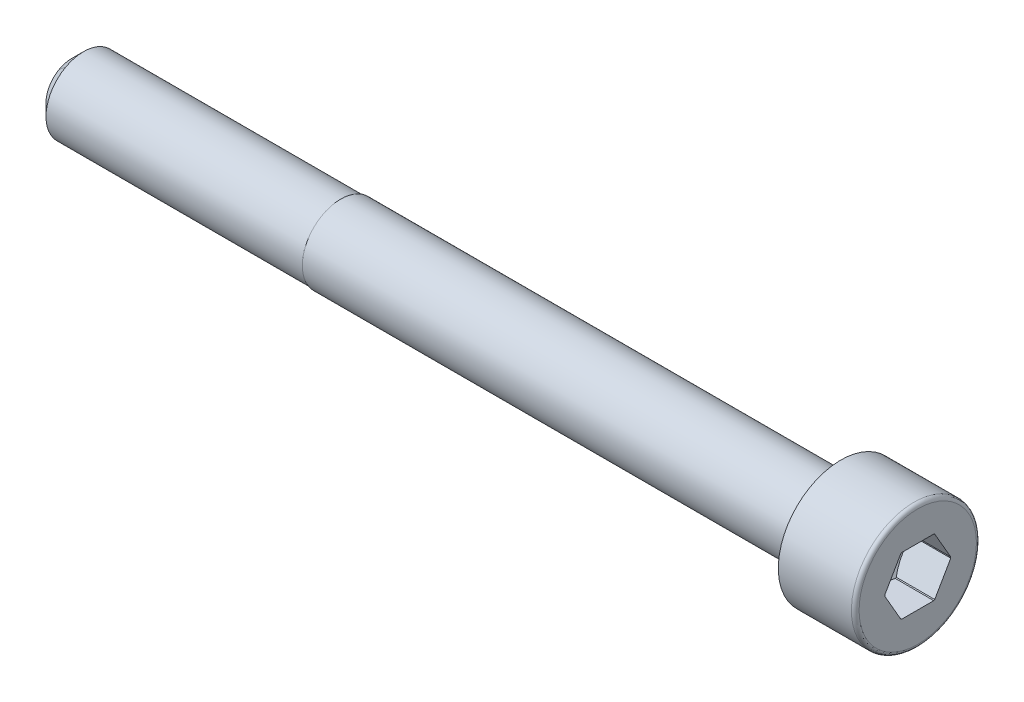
ISO-10303-21;
HEADER;
FILE_DESCRIPTION(('STEP AP214'),'2;1');
FILE_NAME('part.step','',(''),(''),'','','');
FILE_SCHEMA(('AUTOMOTIVE_DESIGN { 1 0 10303 214 1 1 1 1 }'));
ENDSEC;
DATA;
#1=APPLICATION_CONTEXT('core data for automotive mechanical design processes');
#2=APPLICATION_PROTOCOL_DEFINITION('international standard','automotive_design',2000,#1);
#3=PRODUCT_CONTEXT('',#1,'mechanical');
#4=PRODUCT('Part','Part','',(#3));
#5=PRODUCT_RELATED_PRODUCT_CATEGORY('part','',(#4));
#6=PRODUCT_DEFINITION_FORMATION('','',#4);
#7=PRODUCT_DEFINITION_CONTEXT('part definition',#1,'design');
#8=PRODUCT_DEFINITION('design','',#6,#7);
#9=PRODUCT_DEFINITION_SHAPE('','',#8);
#10=(LENGTH_UNIT() NAMED_UNIT(*) SI_UNIT(.MILLI.,.METRE.));
#11=(NAMED_UNIT(*) PLANE_ANGLE_UNIT() SI_UNIT($,.RADIAN.));
#12=(NAMED_UNIT(*) SI_UNIT($,.STERADIAN.) SOLID_ANGLE_UNIT());
#13=UNCERTAINTY_MEASURE_WITH_UNIT(LENGTH_MEASURE(1.E-05),#10,'distance_accuracy_value','');
#14=(GEOMETRIC_REPRESENTATION_CONTEXT(3) GLOBAL_UNCERTAINTY_ASSIGNED_CONTEXT((#13)) GLOBAL_UNIT_ASSIGNED_CONTEXT((#10,
#11,#12)) REPRESENTATION_CONTEXT('',''));
#15=CARTESIAN_POINT('',(0.,0.,0.));
#16=DIRECTION('',(0.,0.,1.));
#17=DIRECTION('',(1.,0.,0.));
#18=AXIS2_PLACEMENT_3D('',#15,#16,#17);
#19=CARTESIAN_POINT('',(5.00941127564,0.,0.));
#20=DIRECTION('',(-1.,0.,0.));
#21=DIRECTION('',(0.,0.,1.));
#22=AXIS2_PLACEMENT_3D('',#19,#20,#21);
#23=CYLINDRICAL_SURFACE('',#22,3.4315);
#24=DIRECTION('',(1.,0.,0.));
#25=VECTOR('',#24,1.);
#26=CARTESIAN_POINT('',(8.,3.,-1.66589082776));
#27=LINE('',#26,#25);
#28=CARTESIAN_POINT('',(4.00000000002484,3.,-1.66589082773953));
#29=VERTEX_POINT('',#28);
#30=CARTESIAN_POINT('',(8.,3.,-1.66589082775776));
#31=VERTEX_POINT('',#30);
#32=EDGE_CURVE('E153',#29,#31,#27,.T.);
#33=ORIENTED_EDGE('',*,*,#32,.F.);
#34=CARTESIAN_POINT('',(4.0000000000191,0.,0.));
#35=DIRECTION('',(1.,0.,0.));
#36=DIRECTION('',(0.,0.479425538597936,0.877582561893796));
#37=AXIS2_PLACEMENT_3D('',#34,#35,#36);
#38=CIRCLE('',#37,3.43149999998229);
#39=CARTESIAN_POINT('',(4.0000000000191,2.94270377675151,-1.76513079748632));
#40=VERTEX_POINT('',#39);
#41=EDGE_CURVE('E148',#29,#40,#38,.F.);
#42=ORIENTED_EDGE('',*,*,#41,.T.);
#43=DIRECTION('',(1.,0.,0.));
#44=VECTOR('',#43,1.);
#45=CARTESIAN_POINT('',(8.,2.94270377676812,-1.76513079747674));
#46=LINE('',#45,#44);
#47=CARTESIAN_POINT('',(8.,2.94270377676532,-1.76513079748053));
#48=VERTEX_POINT('',#47);
#49=EDGE_CURVE('E147',#48,#40,#46,.F.);
#50=ORIENTED_EDGE('',*,*,#49,.F.);
#51=CARTESIAN_POINT('',(8.,0.,0.));
#52=DIRECTION('',(1.,0.,0.));
#53=DIRECTION('',(0.,0.,-1.));
#54=AXIS2_PLACEMENT_3D('',#51,#52,#53);
#55=CIRCLE('',#54,3.4315);
#56=EDGE_CURVE('E132',#31,#48,#55,.F.);
#57=ORIENTED_EDGE('',*,*,#56,.F.);
#58=EDGE_LOOP('',(#33,#42,#50,#57));
#59=FACE_BOUND('',#58,.T.);
#60=ADVANCED_FACE('F16',(#59),#23,.F.);
#61=CARTESIAN_POINT('',(5.00941127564,0.,0.));
#62=DIRECTION('',(-1.,0.,0.));
#63=DIRECTION('',(0.,0.,1.));
#64=AXIS2_PLACEMENT_3D('',#61,#62,#63);
#65=CYLINDRICAL_SURFACE('',#64,3.4315);
#66=DIRECTION('',(1.,0.,0.));
#67=VECTOR('',#66,1.);
#68=CARTESIAN_POINT('',(8.,-0.0572962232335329,-3.43102162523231));
#69=LINE('',#68,#67);
#70=CARTESIAN_POINT('',(8.,-0.057296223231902,-3.43102162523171));
#71=VERTEX_POINT('',#70);
#72=CARTESIAN_POINT('',(4.0000000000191,-0.0572962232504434,-3.43102162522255));
#73=VERTEX_POINT('',#72);
#74=EDGE_CURVE('E392',#71,#73,#69,.F.);
#75=ORIENTED_EDGE('',*,*,#74,.F.);
#76=CARTESIAN_POINT('',(8.,0.,0.));
#77=DIRECTION('',(1.,0.,0.));
#78=DIRECTION('',(0.,0.,-1.));
#79=AXIS2_PLACEMENT_3D('',#76,#77,#78);
#80=CIRCLE('',#79,3.4315);
#81=CARTESIAN_POINT('',(8.,0.0572962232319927,-3.43102162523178));
#82=VERTEX_POINT('',#81);
#83=EDGE_CURVE('E144',#82,#71,#80,.F.);
#84=ORIENTED_EDGE('',*,*,#83,.F.);
#85=DIRECTION('',(1.,0.,0.));
#86=VECTOR('',#85,1.);
#87=CARTESIAN_POINT('',(8.,0.0572962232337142,-3.43102162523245));
#88=LINE('',#87,#86);
#89=CARTESIAN_POINT('',(4.00000000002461,0.0572962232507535,-3.43102162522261));
#90=VERTEX_POINT('',#89);
#91=EDGE_CURVE('E158',#90,#82,#88,.T.);
#92=ORIENTED_EDGE('',*,*,#91,.F.);
#93=CARTESIAN_POINT('',(4.0000000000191,0.,0.));
#94=DIRECTION('',(1.,0.,0.));
#95=DIRECTION('',(0.,0.479425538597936,0.877582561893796));
#96=AXIS2_PLACEMENT_3D('',#93,#94,#95);
#97=CIRCLE('',#96,3.43149999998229);
#98=EDGE_CURVE('E168',#90,#73,#97,.F.);
#99=ORIENTED_EDGE('',*,*,#98,.T.);
#100=EDGE_LOOP('',(#75,#84,#92,#99));
#101=FACE_BOUND('',#100,.T.);
#102=ADVANCED_FACE('F427',(#101),#65,.F.);
#103=CARTESIAN_POINT('',(5.00941127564,0.,0.));
#104=DIRECTION('',(-1.,0.,0.));
#105=DIRECTION('',(0.,0.,1.));
#106=AXIS2_PLACEMENT_3D('',#103,#104,#105);
#107=CYLINDRICAL_SURFACE('',#106,3.4315);
#108=CARTESIAN_POINT('',(4.0000000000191,0.,0.));
#109=DIRECTION('',(1.,0.,0.));
#110=DIRECTION('',(0.,0.479425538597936,0.877582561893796));
#111=AXIS2_PLACEMENT_3D('',#108,#109,#110);
#112=CIRCLE('',#111,3.43149999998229);
#113=CARTESIAN_POINT('',(4.00000000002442,-2.94270377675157,-1.76513079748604));
#114=VERTEX_POINT('',#113);
#115=CARTESIAN_POINT('',(4.0000000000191,-3.,-1.66589082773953));
#116=VERTEX_POINT('',#115);
#117=EDGE_CURVE('E270',#114,#116,#112,.F.);
#118=ORIENTED_EDGE('',*,*,#117,.T.);
#119=DIRECTION('',(1.,0.,0.));
#120=VECTOR('',#119,1.);
#121=CARTESIAN_POINT('',(8.,-3.,-1.66589082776));
#122=LINE('',#121,#120);
#123=CARTESIAN_POINT('',(8.,-3.,-1.66589082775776));
#124=VERTEX_POINT('',#123);
#125=EDGE_CURVE('E241',#124,#116,#122,.F.);
#126=ORIENTED_EDGE('',*,*,#125,.F.);
#127=CARTESIAN_POINT('',(8.,0.,0.));
#128=DIRECTION('',(1.,0.,0.));
#129=DIRECTION('',(0.,0.,-1.));
#130=AXIS2_PLACEMENT_3D('',#127,#128,#129);
#131=CIRCLE('',#130,3.4315);
#132=CARTESIAN_POINT('',(8.,-2.94270377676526,-1.76513079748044));
#133=VERTEX_POINT('',#132);
#134=EDGE_CURVE('E273',#133,#124,#131,.F.);
#135=ORIENTED_EDGE('',*,*,#134,.F.);
#136=DIRECTION('',(1.,0.,0.));
#137=VECTOR('',#136,1.);
#138=CARTESIAN_POINT('',(8.,-2.94270377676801,-1.76513079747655));
#139=LINE('',#138,#137);
#140=EDGE_CURVE('E389',#114,#133,#139,.T.);
#141=ORIENTED_EDGE('',*,*,#140,.F.);
#142=EDGE_LOOP('',(#118,#126,#135,#141));
#143=FACE_BOUND('',#142,.T.);
#144=ADVANCED_FACE('F416',(#143),#107,.F.);
#145=CARTESIAN_POINT('',(5.00941127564,0.,0.));
#146=DIRECTION('',(-1.,0.,0.));
#147=DIRECTION('',(0.,0.,1.));
#148=AXIS2_PLACEMENT_3D('',#145,#146,#147);
#149=CYLINDRICAL_SURFACE('',#148,3.4315);
#150=DIRECTION('',(1.,0.,0.));
#151=VECTOR('',#150,1.);
#152=CARTESIAN_POINT('',(8.,-3.,1.66589082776));
#153=LINE('',#152,#151);
#154=CARTESIAN_POINT('',(4.00000000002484,-3.,1.66589082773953));
#155=VERTEX_POINT('',#154);
#156=CARTESIAN_POINT('',(8.,-3.,1.66589082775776));
#157=VERTEX_POINT('',#156);
#158=EDGE_CURVE('E240',#155,#157,#153,.T.);
#159=ORIENTED_EDGE('',*,*,#158,.F.);
#160=CARTESIAN_POINT('',(4.0000000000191,0.,0.));
#161=DIRECTION('',(1.,0.,0.));
#162=DIRECTION('',(0.,0.479425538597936,0.877582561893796));
#163=AXIS2_PLACEMENT_3D('',#160,#161,#162);
#164=CIRCLE('',#163,3.43149999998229);
#165=CARTESIAN_POINT('',(4.0000000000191,-2.94270377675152,1.76513079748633));
#166=VERTEX_POINT('',#165);
#167=EDGE_CURVE('E406',#155,#166,#164,.F.);
#168=ORIENTED_EDGE('',*,*,#167,.T.);
#169=DIRECTION('',(1.,0.,0.));
#170=VECTOR('',#169,1.);
#171=CARTESIAN_POINT('',(8.,-2.94270377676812,1.76513079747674));
#172=LINE('',#171,#170);
#173=CARTESIAN_POINT('',(8.,-2.94270377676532,1.76513079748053));
#174=VERTEX_POINT('',#173);
#175=EDGE_CURVE('E382',#174,#166,#172,.F.);
#176=ORIENTED_EDGE('',*,*,#175,.F.);
#177=CARTESIAN_POINT('',(8.,0.,0.));
#178=DIRECTION('',(1.,0.,0.));
#179=DIRECTION('',(0.,0.,-1.));
#180=AXIS2_PLACEMENT_3D('',#177,#178,#179);
#181=CIRCLE('',#180,3.4315);
#182=EDGE_CURVE('E271',#157,#174,#181,.F.);
#183=ORIENTED_EDGE('',*,*,#182,.F.);
#184=EDGE_LOOP('',(#159,#168,#176,#183));
#185=FACE_BOUND('',#184,.T.);
#186=ADVANCED_FACE('F441',(#185),#149,.F.);
#187=CARTESIAN_POINT('',(5.00941127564,0.,0.));
#188=DIRECTION('',(-1.,0.,0.));
#189=DIRECTION('',(0.,0.,1.));
#190=AXIS2_PLACEMENT_3D('',#187,#188,#189);
#191=CYLINDRICAL_SURFACE('',#190,3.4315);
#192=DIRECTION('',(1.,0.,0.));
#193=VECTOR('',#192,1.);
#194=CARTESIAN_POINT('',(8.,0.0572962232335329,3.43102162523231));
#195=LINE('',#194,#193);
#196=CARTESIAN_POINT('',(8.,0.057296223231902,3.43102162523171));
#197=VERTEX_POINT('',#196);
#198=CARTESIAN_POINT('',(4.0000000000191,0.0572962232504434,3.43102162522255));
#199=VERTEX_POINT('',#198);
#200=EDGE_CURVE('E197',#197,#199,#195,.F.);
#201=ORIENTED_EDGE('',*,*,#200,.F.);
#202=CARTESIAN_POINT('',(8.,0.,0.));
#203=DIRECTION('',(1.,0.,0.));
#204=DIRECTION('',(0.,0.,-1.));
#205=AXIS2_PLACEMENT_3D('',#202,#203,#204);
#206=CIRCLE('',#205,3.4315);
#207=CARTESIAN_POINT('',(8.,-0.0572962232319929,3.43102162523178));
#208=VERTEX_POINT('',#207);
#209=EDGE_CURVE('E268',#208,#197,#206,.F.);
#210=ORIENTED_EDGE('',*,*,#209,.F.);
#211=DIRECTION('',(1.,0.,0.));
#212=VECTOR('',#211,1.);
#213=CARTESIAN_POINT('',(8.,-0.0572962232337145,3.43102162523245));
#214=LINE('',#213,#212);
#215=CARTESIAN_POINT('',(4.00000000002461,-0.057296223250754,3.43102162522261));
#216=VERTEX_POINT('',#215);
#217=EDGE_CURVE('E379',#216,#208,#214,.T.);
#218=ORIENTED_EDGE('',*,*,#217,.F.);
#219=CARTESIAN_POINT('',(4.0000000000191,0.,0.));
#220=DIRECTION('',(1.,0.,0.));
#221=DIRECTION('',(0.,0.479425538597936,0.877582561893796));
#222=AXIS2_PLACEMENT_3D('',#219,#220,#221);
#223=CIRCLE('',#222,3.43149999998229);
#224=EDGE_CURVE('E169',#216,#199,#223,.F.);
#225=ORIENTED_EDGE('',*,*,#224,.T.);
#226=EDGE_LOOP('',(#201,#210,#218,#225));
#227=FACE_BOUND('',#226,.T.);
#228=ADVANCED_FACE('F213',(#227),#191,.F.);
#229=CARTESIAN_POINT('',(4.0000000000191,0.,0.));
#230=DIRECTION('',(1.,0.,0.));
#231=DIRECTION('',(0.,0.,-1.));
#232=AXIS2_PLACEMENT_3D('',#229,#230,#231);
#233=CONICAL_SURFACE('',#232,3.43149999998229,1.0471975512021);
#234=CARTESIAN_POINT('',(2.02219020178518,-3.92209341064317E-12,2.14264945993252E-12));
#235=VERTEX_POINT('',#234);
#236=VERTEX_LOOP('',#235);
#237=FACE_BOUND('',#236,.T.);
#238=CARTESIAN_POINT('',(4.00000000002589,0.0572962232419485,3.43102162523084));
#239=CARTESIAN_POINT('',(3.96325492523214,0.17081183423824,3.36548335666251));
#240=CARTESIAN_POINT('',(3.929566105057,0.28514686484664,3.29947199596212));
#241=CARTESIAN_POINT('',(3.86970967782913,0.515490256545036,3.16648317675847));
#242=CARTESIAN_POINT('',(3.8435558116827,0.631501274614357,3.09950418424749));
#243=CARTESIAN_POINT('',(3.80077359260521,0.862380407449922,2.96620605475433));
#244=CARTESIAN_POINT('',(3.78395759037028,0.977221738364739,2.899902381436));
#245=CARTESIAN_POINT('',(3.76016083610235,1.20757941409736,2.76690531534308));
#246=CARTESIAN_POINT('',(3.75317159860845,1.32309508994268,2.70021230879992));
#247=CARTESIAN_POINT('',(3.74938304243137,1.56424529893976,2.56098417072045));
#248=CARTESIAN_POINT('',(3.75351627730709,1.68989180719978,2.48844212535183));
#249=CARTESIAN_POINT('',(3.77363673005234,1.94058202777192,2.34370605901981));
#250=CARTESIAN_POINT('',(3.78963616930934,2.06562498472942,2.2715124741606));
#251=CARTESIAN_POINT('',(3.83267808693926,2.31719015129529,2.1262712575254));
#252=CARTESIAN_POINT('',(3.85996753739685,2.4436796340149,2.05324252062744));
#253=CARTESIAN_POINT('',(3.92364198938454,2.69467514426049,1.90833019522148));
#254=CARTESIAN_POINT('',(3.96000827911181,2.81918469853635,1.83644457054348));
#255=CARTESIAN_POINT('',(4.00000000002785,2.94270377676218,1.76513079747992));
#256=B_SPLINE_CURVE_WITH_KNOTS('',3,(#238,#239,#240,#241,#242,#243,#244,#245,#246,#247,#248,
#249,#250,#251,#252,#253,#254,#255),.UNSPECIFIED.,.F.,.F.,(4,2,2,2,2,2,2,2,4),(0.,
0.408481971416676,0.817704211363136,1.21837417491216,1.61869794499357,2.05360864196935,
2.48896789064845,2.93440148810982,3.3789243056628),.UNSPECIFIED.);
#257=CARTESIAN_POINT('',(4.00000000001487,2.94270377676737,1.76513079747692));
#258=VERTEX_POINT('',#257);
#259=EDGE_CURVE('E189',#199,#258,#256,.T.);
#260=ORIENTED_EDGE('',*,*,#259,.F.);
#261=ORIENTED_EDGE('',*,*,#224,.F.);
#262=CARTESIAN_POINT('',(4.00000000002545,-2.94270377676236,1.76513079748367));
#263=CARTESIAN_POINT('',(3.95761571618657,-2.8118234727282,1.84069457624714));
#264=CARTESIAN_POINT('',(3.9193099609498,-2.67981268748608,1.9169110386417));
#265=CARTESIAN_POINT('',(3.85299680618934,-2.41358638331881,2.07061686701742));
#266=CARTESIAN_POINT('',(3.82501189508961,-2.27936670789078,2.14810863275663));
#267=CARTESIAN_POINT('',(3.78220050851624,-2.01256396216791,2.30214726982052));
#268=CARTESIAN_POINT('',(3.76707654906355,-1.88001803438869,2.37867269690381));
#269=CARTESIAN_POINT('',(3.75031731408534,-1.61441682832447,2.53201762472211));
#270=CARTESIAN_POINT('',(3.74866675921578,-1.4813622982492,2.60883669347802));
#271=CARTESIAN_POINT('',(3.75800702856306,-1.240344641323,2.7479883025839));
#272=CARTESIAN_POINT('',(3.76670796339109,-1.13230895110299,2.81036273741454));
#273=CARTESIAN_POINT('',(3.79254998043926,-0.916926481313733,2.93471386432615));
#274=CARTESIAN_POINT('',(3.80969720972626,-0.809580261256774,2.99669023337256));
#275=CARTESIAN_POINT('',(3.8518773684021,-0.593876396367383,3.12122691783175));
#276=CARTESIAN_POINT('',(3.8770609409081,-0.485541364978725,3.18377417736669));
#277=CARTESIAN_POINT('',(3.93394629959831,-0.270335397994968,3.30802340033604));
#278=CARTESIAN_POINT('',(3.96563762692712,-0.163462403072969,3.36972655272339));
#279=CARTESIAN_POINT('',(4.00000000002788,-0.0572962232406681,3.43102162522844));
#280=B_SPLINE_CURVE_WITH_KNOTS('',3,(#262,#263,#264,#265,#266,#267,#268,#269,#270,#271,#272,
#273,#274,#275,#276,#277,#278,#279),.UNSPECIFIED.,.F.,.F.,(4,2,2,2,2,2,2,2,4),(0.,
0.471055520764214,0.943131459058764,1.40396540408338,1.86427667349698,2.23913478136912,
2.61426610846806,2.99688901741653,3.37890174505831),.UNSPECIFIED.);
#281=EDGE_CURVE('E198',#166,#216,#280,.T.);
#282=ORIENTED_EDGE('',*,*,#281,.F.);
#283=ORIENTED_EDGE('',*,*,#167,.F.);
#284=CARTESIAN_POINT('',(4.00000000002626,-3.000000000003,-1.66589082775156));
#285=CARTESIAN_POINT('',(3.95761571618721,-3.00000000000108,-1.51476327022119));
#286=CARTESIAN_POINT('',(3.91930996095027,-3.00000000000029,-1.36233034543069));
#287=CARTESIAN_POINT('',(3.85299680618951,-2.99999999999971,-1.05491868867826));
#288=CARTESIAN_POINT('',(3.82501189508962,-2.99999999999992,-0.899935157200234));
#289=CARTESIAN_POINT('',(3.78220050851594,-3.00000000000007,-0.591857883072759));
#290=CARTESIAN_POINT('',(3.76707654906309,-3.00000000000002,-0.438807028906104));
#291=CARTESIAN_POINT('',(3.75031731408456,-2.99999999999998,-0.132117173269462));
#292=CARTESIAN_POINT('',(3.74866675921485,-2.99999999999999,0.0215209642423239));
#293=CARTESIAN_POINT('',(3.75800702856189,-3.,0.299824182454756));
#294=CARTESIAN_POINT('',(3.76670796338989,-3.,0.424573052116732));
#295=CARTESIAN_POINT('',(3.79254998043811,-3.,0.673275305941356));
#296=CARTESIAN_POINT('',(3.80969720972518,-3.,0.797228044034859));
#297=CARTESIAN_POINT('',(3.85187736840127,-3.,1.04630141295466));
#298=CARTESIAN_POINT('',(3.87706094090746,-3.,1.17139593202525));
#299=CARTESIAN_POINT('',(3.93394629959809,-3.,1.41989437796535));
#300=CARTESIAN_POINT('',(3.96563762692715,-3.,1.54330068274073));
#301=CARTESIAN_POINT('',(4.00000000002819,-3.,1.6658908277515));
#302=B_SPLINE_CURVE_WITH_KNOTS('',3,(#284,#285,#286,#287,#288,#289,#290,#291,#292,#293,#294,
#295,#296,#297,#298,#299,#300,#301),.UNSPECIFIED.,.F.,.F.,(4,2,2,2,2,2,2,2,4),(0.,
0.471055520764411,0.943131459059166,1.40396540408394,1.86427667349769,2.23913478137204,
2.61426610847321,2.99688901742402,3.37890174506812),.UNSPECIFIED.);
#303=EDGE_CURVE('E234',#116,#155,#302,.T.);
#304=ORIENTED_EDGE('',*,*,#303,.F.);
#305=ORIENTED_EDGE('',*,*,#117,.F.);
#306=CARTESIAN_POINT('',(4.00000000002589,-0.0572962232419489,-3.43102162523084));
#307=CARTESIAN_POINT('',(3.96325492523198,-0.170811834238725,-3.36548335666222));
#308=CARTESIAN_POINT('',(3.92956610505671,-0.285146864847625,-3.29947199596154));
#309=CARTESIAN_POINT('',(3.86970967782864,-0.515490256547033,-3.16648317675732));
#310=CARTESIAN_POINT('',(3.84355581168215,-0.631501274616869,-3.09950418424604));
#311=CARTESIAN_POINT('',(3.80077359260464,-0.862380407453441,-2.96620605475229));
#312=CARTESIAN_POINT('',(3.78395759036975,-0.977221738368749,-2.89990238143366));
#313=CARTESIAN_POINT('',(3.76016083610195,-1.20757941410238,-2.7669053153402));
#314=CARTESIAN_POINT('',(3.75317159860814,-1.32309508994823,-2.70021230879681));
#315=CARTESIAN_POINT('',(3.74938304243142,-1.5642452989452,-2.56098417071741));
#316=CARTESIAN_POINT('',(3.75351627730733,-1.68989180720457,-2.4884421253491));
#317=CARTESIAN_POINT('',(3.77363673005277,-1.94058202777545,-2.34370605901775));
#318=CARTESIAN_POINT('',(3.78963616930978,-2.06562498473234,-2.27151247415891));
#319=CARTESIAN_POINT('',(3.83267808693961,-2.31719015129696,-2.12627125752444));
#320=CARTESIAN_POINT('',(3.8599675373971,-2.44367963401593,-2.05324252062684));
#321=CARTESIAN_POINT('',(3.92364198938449,-2.69467514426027,-1.9083301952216));
#322=CARTESIAN_POINT('',(3.96000827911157,-2.81918469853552,-1.83644457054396));
#323=CARTESIAN_POINT('',(4.00000000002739,-2.94270377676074,-1.76513079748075));
#324=B_SPLINE_CURVE_WITH_KNOTS('',3,(#306,#307,#308,#309,#310,#311,#312,#313,#314,#315,#316,
#317,#318,#319,#320,#321,#322,#323),.UNSPECIFIED.,.F.,.F.,(4,2,2,2,2,2,2,2,4),(0.,
0.408481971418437,0.817704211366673,1.2183741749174,1.6186979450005,2.05360864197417,
2.48896789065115,2.93440148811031,3.37892430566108),.UNSPECIFIED.);
#325=EDGE_CURVE('E229',#73,#114,#324,.T.);
#326=ORIENTED_EDGE('',*,*,#325,.F.);
#327=ORIENTED_EDGE('',*,*,#98,.F.);
#328=CARTESIAN_POINT('',(4.00000000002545,2.94270377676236,-1.76513079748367));
#329=CARTESIAN_POINT('',(3.95761571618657,2.8118234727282,-1.84069457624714));
#330=CARTESIAN_POINT('',(3.91930996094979,2.67981268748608,-1.9169110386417));
#331=CARTESIAN_POINT('',(3.85299680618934,2.41358638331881,-2.07061686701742));
#332=CARTESIAN_POINT('',(3.82501189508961,2.27936670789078,-2.14810863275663));
#333=CARTESIAN_POINT('',(3.78220050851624,2.0125639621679,-2.30214726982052));
#334=CARTESIAN_POINT('',(3.76707654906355,1.88001803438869,-2.37867269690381));
#335=CARTESIAN_POINT('',(3.75031731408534,1.61441682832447,-2.53201762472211));
#336=CARTESIAN_POINT('',(3.74866675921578,1.4813622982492,-2.60883669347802));
#337=CARTESIAN_POINT('',(3.75800702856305,1.240344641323,-2.7479883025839));
#338=CARTESIAN_POINT('',(3.76670796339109,1.13230895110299,-2.81036273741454));
#339=CARTESIAN_POINT('',(3.79254998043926,0.916926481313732,-2.93471386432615));
#340=CARTESIAN_POINT('',(3.80969720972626,0.809580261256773,-2.99669023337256));
#341=CARTESIAN_POINT('',(3.8518773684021,0.593876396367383,-3.12122691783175));
#342=CARTESIAN_POINT('',(3.8770609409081,0.485541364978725,-3.18377417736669));
#343=CARTESIAN_POINT('',(3.93394629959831,0.270335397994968,-3.30802340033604));
#344=CARTESIAN_POINT('',(3.96563762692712,0.163462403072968,-3.36972655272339));
#345=CARTESIAN_POINT('',(4.00000000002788,0.0572962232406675,-3.43102162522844));
#346=B_SPLINE_CURVE_WITH_KNOTS('',3,(#328,#329,#330,#331,#332,#333,#334,#335,#336,#337,#338,
#339,#340,#341,#342,#343,#344,#345),.UNSPECIFIED.,.F.,.F.,(4,2,2,2,2,2,2,2,4),(0.,
0.471055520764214,0.943131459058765,1.40396540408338,1.86427667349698,2.23913478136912,
2.61426610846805,2.99688901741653,3.37890174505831),.UNSPECIFIED.);
#347=EDGE_CURVE('E152',#40,#90,#346,.T.);
#348=ORIENTED_EDGE('',*,*,#347,.F.);
#349=ORIENTED_EDGE('',*,*,#41,.F.);
#350=CARTESIAN_POINT('',(4.00000000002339,3.00000000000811,1.66589082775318));
#351=CARTESIAN_POINT('',(3.95761571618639,3.00000000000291,1.51476327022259));
#352=CARTESIAN_POINT('',(3.91930996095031,3.00000000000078,1.36233034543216));
#353=CARTESIAN_POINT('',(3.85299680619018,2.99999999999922,1.05491868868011));
#354=CARTESIAN_POINT('',(3.82501189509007,2.99999999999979,0.899935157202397));
#355=CARTESIAN_POINT('',(3.78220050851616,3.0000000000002,0.591857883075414));
#356=CARTESIAN_POINT('',(3.76707654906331,3.00000000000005,0.438807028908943));
#357=CARTESIAN_POINT('',(3.75031731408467,2.99999999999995,0.132117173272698));
#358=CARTESIAN_POINT('',(3.74866675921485,2.99999999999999,-0.021520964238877));
#359=CARTESIAN_POINT('',(3.75800702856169,3.00000000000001,-0.299824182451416));
#360=CARTESIAN_POINT('',(3.76670796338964,3.,-0.424573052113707));
#361=CARTESIAN_POINT('',(3.7925499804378,3.,-0.673275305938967));
#362=CARTESIAN_POINT('',(3.80969720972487,3.,-0.797228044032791));
#363=CARTESIAN_POINT('',(3.85187736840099,3.,-1.04630141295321));
#364=CARTESIAN_POINT('',(3.87706094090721,3.,-1.1713959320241));
#365=CARTESIAN_POINT('',(3.93394629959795,3.,-1.41989437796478));
#366=CARTESIAN_POINT('',(3.96563762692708,3.,-1.54330068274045));
#367=CARTESIAN_POINT('',(4.00000000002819,3.,-1.6658908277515));
#368=B_SPLINE_CURVE_WITH_KNOTS('',3,(#350,#351,#352,#353,#354,#355,#356,#357,#358,#359,#360,
#361,#362,#363,#364,#365,#366,#367),.UNSPECIFIED.,.F.,.F.,(4,2,2,2,2,2,2,2,4),(0.,
0.471055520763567,0.943131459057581,1.40396540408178,1.86427667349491,2.23913478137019,
2.61426610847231,2.99688901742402,3.378901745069),.UNSPECIFIED.);
#369=CARTESIAN_POINT('',(4.00000000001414,3.,1.6658908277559));
#370=VERTEX_POINT('',#369);
#371=EDGE_CURVE('E258',#370,#29,#368,.T.);
#372=ORIENTED_EDGE('',*,*,#371,.F.);
#373=CARTESIAN_POINT('',(4.,0.,0.));
#374=DIRECTION('',(-1.,0.,0.));
#375=DIRECTION('',(0.,0.,1.));
#376=AXIS2_PLACEMENT_3D('',#373,#374,#375);
#377=CIRCLE('',#376,3.4315);
#378=EDGE_CURVE('E267',#370,#258,#377,.F.);
#379=ORIENTED_EDGE('',*,*,#378,.T.);
#380=EDGE_LOOP('',(#260,#261,#282,#283,#304,#305,#326,#327,#348,#349,#372,#379));
#381=FACE_BOUND('',#380,.T.);
#382=ADVANCED_FACE('F207',(#237,#381),#233,.F.);
#383=CARTESIAN_POINT('',(5.00941127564,0.,0.));
#384=DIRECTION('',(-1.,0.,0.));
#385=DIRECTION('',(0.,0.,1.));
#386=AXIS2_PLACEMENT_3D('',#383,#384,#385);
#387=CYLINDRICAL_SURFACE('',#386,3.4315);
#388=ORIENTED_EDGE('',*,*,#378,.F.);
#389=DIRECTION('',(1.,0.,0.));
#390=VECTOR('',#389,1.);
#391=CARTESIAN_POINT('',(8.,3.,1.66589082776));
#392=LINE('',#391,#390);
#393=CARTESIAN_POINT('',(8.,3.,1.66589082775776));
#394=VERTEX_POINT('',#393);
#395=EDGE_CURVE('E264',#394,#370,#392,.F.);
#396=ORIENTED_EDGE('',*,*,#395,.F.);
#397=CARTESIAN_POINT('',(8.,0.,0.));
#398=DIRECTION('',(1.,0.,0.));
#399=DIRECTION('',(0.,0.,-1.));
#400=AXIS2_PLACEMENT_3D('',#397,#398,#399);
#401=CIRCLE('',#400,3.4315);
#402=CARTESIAN_POINT('',(8.,2.94270377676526,1.76513079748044));
#403=VERTEX_POINT('',#402);
#404=EDGE_CURVE('E265',#403,#394,#401,.F.);
#405=ORIENTED_EDGE('',*,*,#404,.F.);
#406=DIRECTION('',(1.,0.,0.));
#407=VECTOR('',#406,1.);
#408=CARTESIAN_POINT('',(8.,2.94270377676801,1.76513079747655));
#409=LINE('',#408,#407);
#410=EDGE_CURVE('E164',#258,#403,#409,.T.);
#411=ORIENTED_EDGE('',*,*,#410,.F.);
#412=EDGE_LOOP('',(#388,#396,#405,#411));
#413=FACE_BOUND('',#412,.T.);
#414=ADVANCED_FACE('F212',(#413),#387,.F.);
#415=CARTESIAN_POINT('',(8.,3.,-1.73205080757));
#416=DIRECTION('',(0.,-1.,0.));
#417=DIRECTION('',(0.,0.,-1.));
#418=AXIS2_PLACEMENT_3D('',#415,#416,#417);
#419=PLANE('',#418);
#420=ORIENTED_EDGE('',*,*,#371,.T.);
#421=ORIENTED_EDGE('',*,*,#32,.T.);
#422=DIRECTION('',(0.,0.,-1.));
#423=VECTOR('',#422,1.);
#424=CARTESIAN_POINT('',(8.,3.,0.));
#425=LINE('',#424,#423);
#426=EDGE_CURVE('E143',#394,#31,#425,.T.);
#427=ORIENTED_EDGE('',*,*,#426,.F.);
#428=ORIENTED_EDGE('',*,*,#395,.T.);
#429=EDGE_LOOP('',(#420,#421,#427,#428));
#430=FACE_BOUND('',#429,.T.);
#431=ADVANCED_FACE('F254',(#430),#419,.T.);
#432=CARTESIAN_POINT('',(8.,0.,-3.46410161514));
#433=DIRECTION('',(0.,-0.50000000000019,0.866025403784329));
#434=DIRECTION('',(0.,-0.866025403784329,-0.50000000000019));
#435=AXIS2_PLACEMENT_3D('',#432,#433,#434);
#436=PLANE('',#435);
#437=ORIENTED_EDGE('',*,*,#347,.T.);
#438=ORIENTED_EDGE('',*,*,#91,.T.);
#439=DIRECTION('',(0.,-0.866025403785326,-0.499999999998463));
#440=VECTOR('',#439,1.);
#441=CARTESIAN_POINT('',(8.,2.94270377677,-1.76513079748));
#442=LINE('',#441,#440);
#443=EDGE_CURVE('E141',#48,#82,#442,.T.);
#444=ORIENTED_EDGE('',*,*,#443,.F.);
#445=ORIENTED_EDGE('',*,*,#49,.T.);
#446=EDGE_LOOP('',(#437,#438,#444,#445));
#447=FACE_BOUND('',#446,.T.);
#448=ADVANCED_FACE('F156',(#447),#436,.T.);
#449=CARTESIAN_POINT('',(8.,-3.,-1.73205080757));
#450=DIRECTION('',(0.,0.50000000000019,0.866025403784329));
#451=DIRECTION('',(0.,-0.866025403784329,0.50000000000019));
#452=AXIS2_PLACEMENT_3D('',#449,#450,#451);
#453=PLANE('',#452);
#454=ORIENTED_EDGE('',*,*,#325,.T.);
#455=ORIENTED_EDGE('',*,*,#140,.T.);
#456=DIRECTION('',(0.,-0.866025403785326,0.499999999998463));
#457=VECTOR('',#456,1.);
#458=CARTESIAN_POINT('',(8.,-0.0572962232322,-3.43102162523));
#459=LINE('',#458,#457);
#460=EDGE_CURVE('E159',#71,#133,#459,.T.);
#461=ORIENTED_EDGE('',*,*,#460,.F.);
#462=ORIENTED_EDGE('',*,*,#74,.T.);
#463=EDGE_LOOP('',(#454,#455,#461,#462));
#464=FACE_BOUND('',#463,.T.);
#465=ADVANCED_FACE('F246',(#464),#453,.T.);
#466=CARTESIAN_POINT('',(8.,-3.,1.73205080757));
#467=DIRECTION('',(0.,1.,0.));
#468=DIRECTION('',(0.,0.,1.));
#469=AXIS2_PLACEMENT_3D('',#466,#467,#468);
#470=PLANE('',#469);
#471=ORIENTED_EDGE('',*,*,#303,.T.);
#472=ORIENTED_EDGE('',*,*,#158,.T.);
#473=DIRECTION('',(0.,0.,-1.));
#474=VECTOR('',#473,1.);
#475=CARTESIAN_POINT('',(8.,-3.,0.));
#476=LINE('',#475,#474);
#477=EDGE_CURVE('E162',#124,#157,#476,.F.);
#478=ORIENTED_EDGE('',*,*,#477,.F.);
#479=ORIENTED_EDGE('',*,*,#125,.T.);
#480=EDGE_LOOP('',(#471,#472,#478,#479));
#481=FACE_BOUND('',#480,.T.);
#482=ADVANCED_FACE('F242',(#481),#470,.T.);
#483=CARTESIAN_POINT('',(8.,0.,3.46410161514));
#484=DIRECTION('',(0.,0.50000000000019,-0.866025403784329));
#485=DIRECTION('',(0.,0.866025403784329,0.50000000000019));
#486=AXIS2_PLACEMENT_3D('',#483,#484,#485);
#487=PLANE('',#486);
#488=ORIENTED_EDGE('',*,*,#281,.T.);
#489=ORIENTED_EDGE('',*,*,#217,.T.);
#490=DIRECTION('',(0.,0.866025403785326,0.499999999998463));
#491=VECTOR('',#490,1.);
#492=CARTESIAN_POINT('',(8.,-2.94270377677,1.76513079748));
#493=LINE('',#492,#491);
#494=EDGE_CURVE('E403',#174,#208,#493,.T.);
#495=ORIENTED_EDGE('',*,*,#494,.F.);
#496=ORIENTED_EDGE('',*,*,#175,.T.);
#497=EDGE_LOOP('',(#488,#489,#495,#496));
#498=FACE_BOUND('',#497,.T.);
#499=ADVANCED_FACE('F245',(#498),#487,.T.);
#500=CARTESIAN_POINT('',(8.,3.,1.73205080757));
#501=DIRECTION('',(0.,-0.50000000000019,-0.866025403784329));
#502=DIRECTION('',(0.,0.866025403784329,-0.50000000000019));
#503=AXIS2_PLACEMENT_3D('',#500,#501,#502);
#504=PLANE('',#503);
#505=ORIENTED_EDGE('',*,*,#259,.T.);
#506=ORIENTED_EDGE('',*,*,#410,.T.);
#507=DIRECTION('',(0.,0.866025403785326,-0.499999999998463));
#508=VECTOR('',#507,1.);
#509=CARTESIAN_POINT('',(8.,0.0572962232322,3.43102162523));
#510=LINE('',#509,#508);
#511=EDGE_CURVE('E400',#197,#403,#510,.T.);
#512=ORIENTED_EDGE('',*,*,#511,.F.);
#513=ORIENTED_EDGE('',*,*,#200,.T.);
#514=EDGE_LOOP('',(#505,#506,#512,#513));
#515=FACE_BOUND('',#514,.T.);
#516=ADVANCED_FACE('F204',(#515),#504,.T.);
#517=CARTESIAN_POINT('',(8.,0.,0.));
#518=DIRECTION('',(1.,0.,0.));
#519=DIRECTION('',(0.,0.,-1.));
#520=AXIS2_PLACEMENT_3D('',#517,#518,#519);
#521=PLANE('',#520);
#522=ORIENTED_EDGE('',*,*,#511,.T.);
#523=ORIENTED_EDGE('',*,*,#404,.T.);
#524=ORIENTED_EDGE('',*,*,#426,.T.);
#525=ORIENTED_EDGE('',*,*,#56,.T.);
#526=ORIENTED_EDGE('',*,*,#443,.T.);
#527=ORIENTED_EDGE('',*,*,#83,.T.);
#528=ORIENTED_EDGE('',*,*,#460,.T.);
#529=ORIENTED_EDGE('',*,*,#134,.T.);
#530=ORIENTED_EDGE('',*,*,#477,.T.);
#531=ORIENTED_EDGE('',*,*,#182,.T.);
#532=ORIENTED_EDGE('',*,*,#494,.T.);
#533=ORIENTED_EDGE('',*,*,#209,.T.);
#534=EDGE_LOOP('',(#522,#523,#524,#525,#526,#527,#528,#529,#530,#531,#532,#533));
#535=FACE_BOUND('',#534,.T.);
#536=CARTESIAN_POINT('',(8.,0.,0.));
#537=DIRECTION('',(-1.,0.,0.));
#538=DIRECTION('',(0.,1.,0.));
#539=AXIS2_PLACEMENT_3D('',#536,#537,#538);
#540=CIRCLE('',#539,6.1);
#541=CARTESIAN_POINT('',(8.,6.1,0.));
#542=VERTEX_POINT('',#541);
#543=CARTESIAN_POINT('',(8.,-6.1,0.));
#544=VERTEX_POINT('',#543);
#545=EDGE_CURVE('E188',#542,#544,#540,.T.);
#546=ORIENTED_EDGE('',*,*,#545,.F.);
#547=CARTESIAN_POINT('',(8.,0.,0.));
#548=DIRECTION('',(-1.,0.,0.));
#549=DIRECTION('',(0.,-1.,0.));
#550=AXIS2_PLACEMENT_3D('',#547,#548,#549);
#551=CIRCLE('',#550,6.1);
#552=EDGE_CURVE('E402',#544,#542,#551,.T.);
#553=ORIENTED_EDGE('',*,*,#552,.F.);
#554=EDGE_LOOP('',(#546,#553));
#555=FACE_BOUND('',#554,.T.);
#556=ADVANCED_FACE('F138',(#535,#555),#521,.T.);
#557=CARTESIAN_POINT('',(-80.,3.90243902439,0.));
#558=DIRECTION('',(1.,0.,0.));
#559=DIRECTION('',(0.,0.,-1.));
#560=AXIS2_PLACEMENT_3D('',#557,#558,#559);
#561=PLANE('',#560);
#562=CARTESIAN_POINT('',(-79.999999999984,0.,-1.36822301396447E-13));
#563=DIRECTION('',(1.,0.,1.0945784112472E-13));
#564=DIRECTION('',(1.0945784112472E-13,0.,-1.));
#565=AXIS2_PLACEMENT_3D('',#562,#563,#564);
#566=CIRCLE('',#565,2.65243902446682);
#567=CARTESIAN_POINT('',(-79.9999999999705,-2.32773423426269,-1.27164700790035));
#568=VERTEX_POINT('',#567);
#569=CARTESIAN_POINT('',(-79.999999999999,2.32773423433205,1.27164700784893));
#570=VERTEX_POINT('',#569);
#571=EDGE_CURVE('E181',#568,#570,#566,.T.);
#572=ORIENTED_EDGE('',*,*,#571,.F.);
#573=CARTESIAN_POINT('',(-79.9999999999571,0.,0.));
#574=DIRECTION('',(1.,0.,0.));
#575=DIRECTION('',(0.,0.,-1.));
#576=AXIS2_PLACEMENT_3D('',#573,#574,#575);
#577=CIRCLE('',#576,2.65243902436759);
#578=EDGE_CURVE('E186',#570,#568,#577,.T.);
#579=ORIENTED_EDGE('',*,*,#578,.F.);
#580=EDGE_LOOP('',(#572,#579));
#581=FACE_BOUND('',#580,.T.);
#582=ADVANCED_FACE('F359',(#581),#561,.F.);
#583=CARTESIAN_POINT('',(7.6,0.,0.));
#584=DIRECTION('',(1.,0.,0.));
#585=DIRECTION('',(0.,-0.982387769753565,0.186853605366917));
#586=AXIS2_PLACEMENT_3D('',#583,#584,#585);
#587=TOROIDAL_SURFACE('',#586,6.1,0.4);
#588=CARTESIAN_POINT('',(7.6,0.,0.));
#589=DIRECTION('',(1.,0.,0.));
#590=DIRECTION('',(0.,0.,-1.));
#591=AXIS2_PLACEMENT_3D('',#588,#589,#590);
#592=CIRCLE('',#591,6.5);
#593=CARTESIAN_POINT('',(7.6,0.,-6.5));
#594=VERTEX_POINT('',#593);
#595=EDGE_CURVE('E335',#594,#594,#592,.F.);
#596=ORIENTED_EDGE('',*,*,#595,.F.);
#597=EDGE_LOOP('',(#596));
#598=FACE_BOUND('',#597,.T.);
#599=ORIENTED_EDGE('',*,*,#545,.T.);
#600=ORIENTED_EDGE('',*,*,#552,.T.);
#601=EDGE_LOOP('',(#599,#600));
#602=FACE_BOUND('',#601,.T.);
#603=ADVANCED_FACE('F353',(#598,#602),#587,.T.);
#604=CARTESIAN_POINT('',(-78.7500000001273,0.,0.));
#605=DIRECTION('',(1.,0.,0.));
#606=DIRECTION('',(0.,0.,-1.));
#607=AXIS2_PLACEMENT_3D('',#604,#605,#606);
#608=CONICAL_SURFACE('',#607,3.90243902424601,0.785398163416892);
#609=DIRECTION('',(-0.707106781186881,0.62054458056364,0.339005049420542));
#610=VECTOR('',#609,1.);
#611=CARTESIAN_POINT('',(499000.00000002,-437986.232722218,-239272.969453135));
#612=LINE('',#611,#610);
#613=CARTESIAN_POINT('',(-78.7500000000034,-3.42471243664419,-1.87092893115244));
#614=VERTEX_POINT('',#613);
#615=EDGE_CURVE('E185',#614,#568,#612,.T.);
#616=ORIENTED_EDGE('',*,*,#615,.F.);
#617=CARTESIAN_POINT('',(-78.75,0.,0.));
#618=DIRECTION('',(1.,0.,0.));
#619=DIRECTION('',(0.,0.,-1.));
#620=AXIS2_PLACEMENT_3D('',#617,#618,#619);
#621=CIRCLE('',#620,3.90243902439);
#622=CARTESIAN_POINT('',(-78.7500000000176,3.42471243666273,1.8709289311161));
#623=VERTEX_POINT('',#622);
#624=EDGE_CURVE('E327',#623,#614,#621,.T.);
#625=ORIENTED_EDGE('',*,*,#624,.F.);
#626=DIRECTION('',(-0.707106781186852,-0.620544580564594,-0.339005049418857));
#627=VECTOR('',#626,1.);
#628=CARTESIAN_POINT('',(498999.999999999,437986.232722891,239272.969451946));
#629=LINE('',#628,#627);
#630=EDGE_CURVE('E184',#570,#623,#629,.F.);
#631=ORIENTED_EDGE('',*,*,#630,.F.);
#632=ORIENTED_EDGE('',*,*,#578,.T.);
#633=EDGE_LOOP('',(#616,#625,#631,#632));
#634=FACE_BOUND('',#633,.T.);
#635=ADVANCED_FACE('F358',(#634),#608,.T.);
#636=CARTESIAN_POINT('',(-78.7500000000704,0.,0.));
#637=DIRECTION('',(1.,0.,1.0945784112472E-13));
#638=DIRECTION('',(1.0945784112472E-13,0.,-1.));
#639=AXIS2_PLACEMENT_3D('',#636,#637,#638);
#640=CONICAL_SURFACE('',#639,3.90243902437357,0.7853981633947);
#641=ORIENTED_EDGE('',*,*,#630,.T.);
#642=CARTESIAN_POINT('',(-78.75,0.,0.));
#643=DIRECTION('',(1.,0.,0.));
#644=DIRECTION('',(0.,0.,-1.));
#645=AXIS2_PLACEMENT_3D('',#642,#643,#644);
#646=CIRCLE('',#645,3.90243902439);
#647=EDGE_CURVE('E180',#614,#623,#646,.T.);
#648=ORIENTED_EDGE('',*,*,#647,.F.);
#649=ORIENTED_EDGE('',*,*,#615,.T.);
#650=ORIENTED_EDGE('',*,*,#571,.T.);
#651=EDGE_LOOP('',(#641,#648,#649,#650));
#652=FACE_BOUND('',#651,.T.);
#653=ADVANCED_FACE('F468',(#652),#640,.T.);
#654=CARTESIAN_POINT('',(4.,0.,0.));
#655=DIRECTION('',(1.,0.,0.));
#656=DIRECTION('',(0.,0.,-1.));
#657=AXIS2_PLACEMENT_3D('',#654,#655,#656);
#658=CYLINDRICAL_SURFACE('',#657,6.5);
#659=CARTESIAN_POINT('',(0.,0.,0.));
#660=DIRECTION('',(1.,0.,0.));
#661=DIRECTION('',(0.,0.,-1.));
#662=AXIS2_PLACEMENT_3D('',#659,#660,#661);
#663=CIRCLE('',#662,6.5);
#664=CARTESIAN_POINT('',(0.,0.,-6.5));
#665=VERTEX_POINT('',#664);
#666=EDGE_CURVE('E177',#665,#665,#663,.T.);
#667=ORIENTED_EDGE('',*,*,#666,.T.);
#668=EDGE_LOOP('',(#667));
#669=FACE_BOUND('',#668,.T.);
#670=ORIENTED_EDGE('',*,*,#595,.T.);
#671=EDGE_LOOP('',(#670));
#672=FACE_BOUND('',#671,.T.);
#673=ADVANCED_FACE('F465',(#669,#672),#658,.T.);
#674=CARTESIAN_POINT('',(-40.,0.,0.));
#675=DIRECTION('',(1.,0.,0.));
#676=DIRECTION('',(0.,0.,-1.));
#677=AXIS2_PLACEMENT_3D('',#674,#675,#676);
#678=CYLINDRICAL_SURFACE('',#677,3.90243902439);
#679=CARTESIAN_POINT('',(-52.,0.,0.));
#680=DIRECTION('',(1.,0.,0.));
#681=DIRECTION('',(0.,0.,-1.));
#682=AXIS2_PLACEMENT_3D('',#679,#680,#681);
#683=CIRCLE('',#682,3.90243902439);
#684=CARTESIAN_POINT('',(-52.,0.,-3.90243902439));
#685=VERTEX_POINT('',#684);
#686=EDGE_CURVE('E174',#685,#685,#683,.F.);
#687=ORIENTED_EDGE('',*,*,#686,.T.);
#688=EDGE_LOOP('',(#687));
#689=FACE_BOUND('',#688,.T.);
#690=ORIENTED_EDGE('',*,*,#647,.T.);
#691=ORIENTED_EDGE('',*,*,#624,.T.);
#692=EDGE_LOOP('',(#690,#691));
#693=FACE_BOUND('',#692,.T.);
#694=ADVANCED_FACE('F313',(#689,#693),#678,.T.);
#695=CARTESIAN_POINT('',(0.,0.,0.));
#696=DIRECTION('',(1.,0.,0.));
#697=DIRECTION('',(0.,0.,-1.));
#698=AXIS2_PLACEMENT_3D('',#695,#696,#697);
#699=PLANE('',#698);
#700=CARTESIAN_POINT('',(0.,-3.86136327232,-2.10947236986));
#701=CARTESIAN_POINT('',(-1.21326223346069E-09,-3.89670172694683,-2.0447857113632));
#702=CARTESIAN_POINT('',(1.32699946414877E-09,-3.93042770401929,-1.97921930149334));
#703=CARTESIAN_POINT('',(-7.12735861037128E-09,-3.99457332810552,-1.84649032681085));
#704=CARTESIAN_POINT('',(-1.81216945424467E-08,-4.02499304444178,-1.77932779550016));
#705=CARTESIAN_POINT('',(-7.46854945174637E-08,-4.08244629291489,-1.64356712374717));
#706=CARTESIAN_POINT('',(-1.20254996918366E-07,-4.10947982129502,-1.57496898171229));
#707=CARTESIAN_POINT('',(-3.20920916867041E-07,-4.15378429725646,-1.45382914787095));
#708=CARTESIAN_POINT('',(-4.4579385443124E-07,-4.17180647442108,-1.40155985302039));
#709=CARTESIAN_POINT('',(-7.86529102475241E-07,-4.21720698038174,-1.26125175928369));
#710=CARTESIAN_POINT('',(-1.00749011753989E-06,-4.24280088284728,-1.17262518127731));
#711=CARTESIAN_POINT('',(-1.03008738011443E-06,-4.28365374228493,-1.01179618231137));
#712=CARTESIAN_POINT('',(-9.06770494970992E-07,-4.29995593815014,-0.939855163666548));
#713=CARTESIAN_POINT('',(-5.32928166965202E-07,-4.32884272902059,-0.795237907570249));
#714=CARTESIAN_POINT('',(-2.82427293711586E-07,-4.34142804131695,-0.722561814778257));
#715=CARTESIAN_POINT('',(-5.71283372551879E-08,-4.35745076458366,-0.613144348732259));
#716=CARTESIAN_POINT('',(-7.10279579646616E-09,-4.36231562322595,-0.57660650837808));
#717=CARTESIAN_POINT('',(7.61830527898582E-09,-4.37147723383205,-0.500768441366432));
#718=CARTESIAN_POINT('',(-3.41427620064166E-08,-4.3757071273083,-0.461460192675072));
#719=CARTESIAN_POINT('',(-3.66066069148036E-08,-4.38286922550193,-0.387865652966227));
#720=CARTESIAN_POINT('',(-7.11556706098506E-09,-4.38589857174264,-0.353588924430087));
#721=CARTESIAN_POINT('',(3.90583451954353E-10,-4.38977859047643,-0.301263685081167));
#722=CARTESIAN_POINT('',(-3.79577869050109E-09,-4.39098059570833,-0.283241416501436));
#723=CARTESIAN_POINT('',(-1.20997767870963E-08,-4.39467156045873,-0.222194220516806));
#724=CARTESIAN_POINT('',(-8.07975338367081E-09,-4.39663511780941,-0.179137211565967));
#725=CARTESIAN_POINT('',(-1.79925341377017E-09,-4.40006944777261,-0.0677335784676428));
#726=CARTESIAN_POINT('',(-1.95073957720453E-09,-4.40057699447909,0.000645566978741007));
#727=CARTESIAN_POINT('',(-1.07862615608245E-09,-4.39882372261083,0.111157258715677));
#728=CARTESIAN_POINT('',(-4.82991361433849E-10,-4.39754902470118,0.153308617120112));
#729=CARTESIAN_POINT('',(4.56141549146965E-12,-4.3939811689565,0.233340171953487));
#730=CARTESIAN_POINT('',(-3.90380644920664E-11,-4.39180275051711,0.271225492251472));
#731=CARTESIAN_POINT('',(-6.36076822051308E-11,-4.38558392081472,0.359540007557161));
#732=CARTESIAN_POINT('',(-1.88741909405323E-11,-4.38116496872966,0.409943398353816));
#733=CARTESIAN_POINT('',(-7.86326993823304E-10,-4.37350339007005,0.482917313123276));
#734=CARTESIAN_POINT('',(-1.1411486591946E-09,-4.37094865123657,0.505562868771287));
#735=CARTESIAN_POINT('',(-2.77955427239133E-09,-4.35854622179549,0.608298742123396));
#736=CARTESIAN_POINT('',(-4.13237145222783E-09,-4.34666085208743,0.68815547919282));
#737=CARTESIAN_POINT('',(-4.79769467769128E-09,-4.31850731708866,0.847085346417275));
#738=CARTESIAN_POINT('',(-4.11019857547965E-09,-4.30223914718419,0.926158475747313));
#739=CARTESIAN_POINT('',(-1.70076409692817E-09,-4.26536392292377,1.08328789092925));
#740=CARTESIAN_POINT('',(2.11667740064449E-11,-4.24475690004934,1.16134418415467));
#741=CARTESIAN_POINT('',(-2.09990847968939E-11,-4.19945986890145,1.31559066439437));
#742=CARTESIAN_POINT('',(-1.75760423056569E-09,-4.17480347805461,1.39179073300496));
#743=CARTESIAN_POINT('',(-5.44383356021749E-09,-4.12138039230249,1.54273546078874));
#744=CARTESIAN_POINT('',(-7.39345565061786E-09,-4.09261373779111,1.61748013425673));
#745=CARTESIAN_POINT('',(-9.68641014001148E-09,-4.03105215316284,1.7652913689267));
#746=CARTESIAN_POINT('',(-1.00297492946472E-08,-3.99825723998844,1.83835793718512));
#747=CARTESIAN_POINT('',(-8.87258411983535E-09,-3.92873729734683,1.98259703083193));
#748=CARTESIAN_POINT('',(-7.372077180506E-09,-3.89201226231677,2.05376955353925));
#749=CARTESIAN_POINT('',(-3.70520611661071E-09,-3.81474019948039,2.19400909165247));
#750=CARTESIAN_POINT('',(-1.53883730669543E-09,-3.77419314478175,2.26307609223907));
#751=CARTESIAN_POINT('',(3.84283668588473E-10,-3.68939872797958,2.39890201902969));
#752=CARTESIAN_POINT('',(1.41005333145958E-10,-3.64515131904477,2.46566091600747));
#753=CARTESIAN_POINT('',(-5.75877902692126E-09,-3.55621082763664,2.59221232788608));
#754=CARTESIAN_POINT('',(-1.10462576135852E-08,-3.51175241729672,2.65216993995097));
#755=CARTESIAN_POINT('',(-2.24172395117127E-08,-3.41983707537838,2.76974297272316));
#756=CARTESIAN_POINT('',(-2.85007531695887E-08,-3.37238010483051,2.82735836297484));
#757=CARTESIAN_POINT('',(-3.94975654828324E-08,-3.27459320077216,2.94009785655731));
#758=CARTESIAN_POINT('',(-4.44108537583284E-08,-3.22426324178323,2.99522193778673));
#759=CARTESIAN_POINT('',(-5.15824017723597E-08,-3.12086057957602,3.10283524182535));
#760=CARTESIAN_POINT('',(-5.3840648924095E-08,-3.06778786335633,3.15532445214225));
#761=CARTESIAN_POINT('',(-5.51379303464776E-08,-2.95903779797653,3.25753153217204));
#762=CARTESIAN_POINT('',(-5.41769626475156E-08,-2.90336044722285,3.30724940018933));
#763=CARTESIAN_POINT('',(-4.92744496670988E-08,-2.78954591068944,3.40378463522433));
#764=CARTESIAN_POINT('',(-4.53329148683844E-08,-2.73140873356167,3.45060201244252));
#765=CARTESIAN_POINT('',(-3.55428109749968E-08,-2.61282545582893,3.54121407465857));
#766=CARTESIAN_POINT('',(-2.96942564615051E-08,-2.55237937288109,3.58500878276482));
#767=CARTESIAN_POINT('',(-1.7988083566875E-08,-2.42933653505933,3.66946349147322));
#768=CARTESIAN_POINT('',(-1.21304652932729E-08,-2.36673980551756,3.71012352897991));
#769=CARTESIAN_POINT('',(-3.13845934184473E-09,-2.23955456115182,3.78819649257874));
#770=CARTESIAN_POINT('',(-4.02835555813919E-12,-2.17496607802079,3.82560947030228));
#771=CARTESIAN_POINT('',(3.97604376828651E-12,-2.04483090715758,3.8966518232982));
#772=CARTESIAN_POINT('',(-3.04151106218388E-09,-1.97930762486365,3.93032409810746));
#773=CARTESIAN_POINT('',(8.40814574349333E-10,-1.84667292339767,3.99437327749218));
#774=CARTESIAN_POINT('',(7.76825386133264E-09,-1.7795615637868,4.02475030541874));
#775=CARTESIAN_POINT('',(-1.49390228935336E-08,-1.64391673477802,4.08214068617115));
#776=CARTESIAN_POINT('',(-4.45733173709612E-08,-1.5753832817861,4.10915407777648));
#777=CARTESIAN_POINT('',(-1.11275186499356E-07,-1.43704327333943,4.15970770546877));
#778=CARTESIAN_POINT('',(-1.48342868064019E-07,-1.36723669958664,4.18324789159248));
#779=CARTESIAN_POINT('',(-4.59277004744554E-07,-1.27682261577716,4.21135313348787));
#780=CARTESIAN_POINT('',(-5.45099036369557E-07,-1.25668683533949,4.21746204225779));
#781=CARTESIAN_POINT('',(-5.68293732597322E-07,-1.21834444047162,4.22870370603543));
#782=CARTESIAN_POINT('',(-5.19788091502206E-07,-1.200148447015,4.23387272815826));
#783=CARTESIAN_POINT('',(-2.90501853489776E-07,-1.1019423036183,4.26110322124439));
#784=CARTESIAN_POINT('',(-2.18240847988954E-07,-1.02133580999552,4.28107333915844));
#785=CARTESIAN_POINT('',(-9.87991029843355E-08,-0.885748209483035,4.3105719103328));
#786=CARTESIAN_POINT('',(-5.11709624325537E-08,-0.831039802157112,4.32137619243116));
#787=CARTESIAN_POINT('',(-1.66613784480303E-08,-0.74695004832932,4.33636055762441));
#788=CARTESIAN_POINT('',(-1.17824185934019E-08,-0.717697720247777,4.34127441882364));
#789=CARTESIAN_POINT('',(3.74351138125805E-10,-0.612665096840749,4.35784878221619));
#790=CARTESIAN_POINT('',(-7.99583020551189E-10,-0.536615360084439,4.36786009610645));
#791=CARTESIAN_POINT('',(-1.83592332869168E-09,-0.402709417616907,4.38195049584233));
#792=CARTESIAN_POINT('',(-1.94841342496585E-09,-0.344940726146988,4.3868809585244));
#793=CARTESIAN_POINT('',(-3.29119294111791E-09,-0.252882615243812,4.39291268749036));
#794=CARTESIAN_POINT('',(-4.04617592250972E-09,-0.218640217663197,4.39475543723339));
#795=CARTESIAN_POINT('',(-6.4700520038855E-09,-0.104444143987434,4.39956035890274));
#796=CARTESIAN_POINT('',(-8.01554872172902E-09,-0.0244071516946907,4.40073995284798));
#797=CARTESIAN_POINT('',(-1.04243442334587E-08,0.135606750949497,4.39872922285));
#798=CARTESIAN_POINT('',(-1.1287640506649E-08,0.215583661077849,4.39553888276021));
#799=CARTESIAN_POINT('',(-1.18562853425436E-08,0.375245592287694,4.38479753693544));
#800=CARTESIAN_POINT('',(-1.15616332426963E-08,0.454930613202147,4.37724652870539));
#801=CARTESIAN_POINT('',(-9.96535786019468E-09,0.613769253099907,4.35780624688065));
#802=CARTESIAN_POINT('',(-8.66373714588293E-09,0.692922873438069,4.34591698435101));
#803=CARTESIAN_POINT('',(-5.63136141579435E-09,0.850462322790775,4.31783646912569));
#804=CARTESIAN_POINT('',(-3.9006088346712E-09,0.928848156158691,4.30164524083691));
#805=CARTESIAN_POINT('',(-1.09155333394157E-09,1.08462037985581,4.2650062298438));
#806=CARTESIAN_POINT('',(-1.32446754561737E-11,1.16200677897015,4.24455848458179));
#807=CARTESIAN_POINT('',(9.85321290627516E-12,1.29588336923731,4.20525009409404));
#808=CARTESIAN_POINT('',(-5.69734755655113E-10,1.35265009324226,4.18732383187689));
#809=CARTESIAN_POINT('',(-1.98054317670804E-09,1.47134447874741,4.14718088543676));
#810=CARTESIAN_POINT('',(-2.83182052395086E-09,1.53318685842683,4.12471124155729));
#811=CARTESIAN_POINT('',(-4.3384802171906E-09,1.66163922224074,4.07475462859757));
#812=CARTESIAN_POINT('',(-4.96750542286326E-09,1.72814274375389,4.04699366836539));
#813=CARTESIAN_POINT('',(-5.76240067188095E-09,1.86542491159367,3.98568986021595));
#814=CARTESIAN_POINT('',(-5.8832694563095E-09,1.93607282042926,3.95185420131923));
#815=CARTESIAN_POINT('',(-5.61006161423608E-09,2.08104192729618,3.87760564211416));
#816=CARTESIAN_POINT('',(-5.1740403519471E-09,2.15520519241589,3.83688316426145));
#817=CARTESIAN_POINT('',(-4.27469070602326E-09,2.2666148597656,3.77146328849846));
#818=CARTESIAN_POINT('',(-3.92146741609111E-09,2.30475778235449,3.74827833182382));
#819=CARTESIAN_POINT('',(-3.1673912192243E-09,2.38164762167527,3.6999249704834));
#820=CARTESIAN_POINT('',(-2.76530220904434E-09,2.42036879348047,3.67471551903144));
#821=CARTESIAN_POINT('',(-1.97567586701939E-09,2.49829651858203,3.62221542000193));
#822=CARTESIAN_POINT('',(-1.58909345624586E-09,2.53747505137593,3.59488319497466));
#823=CARTESIAN_POINT('',(-8.79240342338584E-10,2.61619131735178,3.53804182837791));
#824=CARTESIAN_POINT('',(-5.58460257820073E-10,2.65569872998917,3.5084906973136));
#825=CARTESIAN_POINT('',(-1.54214274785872E-10,2.7349355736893,3.44711638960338));
#826=CARTESIAN_POINT('',(-7.86035424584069E-11,2.77463225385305,3.41525086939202));
#827=CARTESIAN_POINT('',(5.69205820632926E-11,2.84210246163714,3.35914585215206));
#828=CARTESIAN_POINT('',(1.15410532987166E-10,2.87014430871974,3.33522750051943));
#829=CARTESIAN_POINT('',(-2.42022813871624E-09,2.95336247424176,3.26243704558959));
#830=CARTESIAN_POINT('',(-7.72493791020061E-09,3.00763692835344,3.21252518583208));
#831=CARTESIAN_POINT('',(-4.10821121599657E-08,3.11362278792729,3.11006114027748));
#832=CARTESIAN_POINT('',(-6.91344336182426E-08,3.16533420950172,3.05750897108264));
#833=CARTESIAN_POINT('',(-2.48197800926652E-07,3.27868555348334,2.93644416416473));
#834=CARTESIAN_POINT('',(-4.28189772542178E-07,3.33957643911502,2.86722540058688));
#835=CARTESIAN_POINT('',(-8.01694739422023E-07,3.43342528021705,2.75349546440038));
#836=CARTESIAN_POINT('',(-9.61071840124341E-07,3.4678232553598,2.71016239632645));
#837=CARTESIAN_POINT('',(-1.16467968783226E-06,3.54608625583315,2.60753256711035));
#838=CARTESIAN_POINT('',(-1.15286426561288E-06,3.58928767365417,2.5477267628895));
#839=CARTESIAN_POINT('',(-9.04831250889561E-07,3.67254172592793,2.42598128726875));
#840=CARTESIAN_POINT('',(-6.68653382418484E-07,3.7125949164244,2.36404199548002));
#841=CARTESIAN_POINT('',(-2.37313758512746E-07,3.78944472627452,2.23819578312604));
#842=CARTESIAN_POINT('',(-4.21420642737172E-08,3.82624213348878,2.17428934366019));
#843=CARTESIAN_POINT('',(0.,3.86136327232,2.10947236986));
#844=B_SPLINE_CURVE_WITH_KNOTS('',3,(#700,#701,#702,#703,#704,#705,#706,#707,#708,#709,#710,
#711,#712,#713,#714,#715,#716,#717,#718,#719,#720,#721,#722,#723,#724,#725,#726,#727,#728,#729,
#730,#731,#732,#733,#734,#735,#736,#737,#738,#739,#740,#741,#742,#743,#744,#745,#746,#747,#748,
#749,#750,#751,#752,#753,#754,#755,#756,#757,#758,#759,#760,#761,#762,#763,#764,#765,#766,#767,
#768,#769,#770,#771,#772,#773,#774,#775,#776,#777,#778,#779,#780,#781,#782,#783,#784,#785,#786,
#787,#788,#789,#790,#791,#792,#793,#794,#795,#796,#797,#798,#799,#800,#801,#802,#803,#804,#805,
#806,#807,#808,#809,#810,#811,#812,#813,#814,#815,#816,#817,#818,#819,#820,#821,#822,#823,#824,
#825,#826,#827,#828,#829,#830,#831,#832,#833,#834,#835,#836,#837,#838,#839,#840,#841,#842,#843),
.UNSPECIFIED.,.F.,.F.,(4,2,2,2,2,2,2,2,2,2,2,2,2,2,2,2,2,2,2,2,2,2,2,2,2,2,2,2,2,2,2,2,2,2,2,2,
2,2,2,2,2,2,2,2,2,2,2,2,2,2,2,2,2,2,2,2,2,2,2,2,2,2,2,2,2,2,2,2,2,2,2,4),(0.,0.221105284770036,
0.442205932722,0.663306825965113,0.82914309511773,1.10567241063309,1.32687885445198,
1.54804258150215,1.65861319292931,1.77720883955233,1.8804303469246,1.9346155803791,
2.06390349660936,2.26896228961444,2.39545872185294,2.50929096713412,2.66104593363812,
2.72941258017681,2.97148178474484,3.2135512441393,3.45561894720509,3.69577015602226,
3.93591900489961,4.17606684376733,4.41621502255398,4.6563648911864,4.89651779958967,
5.12034899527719,5.34418310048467,5.56801919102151,5.79185634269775,6.0156936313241,
6.23953013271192,6.46336492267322,6.68719707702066,6.9110256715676,7.13194166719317,
7.35284939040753,7.57375456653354,7.7946629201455,7.85778694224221,7.91453361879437,
8.16350711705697,8.33076382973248,8.41974680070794,8.64974650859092,8.82363797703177,
8.92650715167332,9.16651194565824,9.40651762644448,9.64652344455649,9.88652865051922,
10.1265324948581,10.366534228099,10.5450788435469,10.7424056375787,10.9585139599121,
11.1934031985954,11.4470727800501,11.5809654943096,11.7195547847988,11.8628407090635,
12.0108233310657,12.163502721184,12.2740649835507,12.4951684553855,12.7162705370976,
12.992637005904,13.1585819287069,13.3798084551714,13.6009958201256,13.822129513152),.UNSPECIFIED.);
#845=CARTESIAN_POINT('',(0.,-3.86136327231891,-2.10947236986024));
#846=VERTEX_POINT('',#845);
#847=CARTESIAN_POINT('',(0.,3.8613632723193,2.10947236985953));
#848=VERTEX_POINT('',#847);
#849=EDGE_CURVE('E35',#846,#848,#844,.T.);
#850=ORIENTED_EDGE('',*,*,#849,.F.);
#851=CARTESIAN_POINT('',(0.,0.,0.));
#852=DIRECTION('',(-1.,0.,0.));
#853=DIRECTION('',(0.,0.877582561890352,0.47942553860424));
#854=AXIS2_PLACEMENT_3D('',#851,#852,#853);
#855=CIRCLE('',#854,4.4000000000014);
#856=EDGE_CURVE('E173',#846,#848,#855,.F.);
#857=ORIENTED_EDGE('',*,*,#856,.T.);
#858=EDGE_LOOP('',(#850,#857));
#859=FACE_BOUND('',#858,.T.);
#860=ORIENTED_EDGE('',*,*,#666,.F.);
#861=EDGE_LOOP('',(#860));
#862=FACE_BOUND('',#861,.T.);
#863=ADVANCED_FACE('F304',(#859,#862),#699,.F.);
#864=CARTESIAN_POINT('',(-52.,4.,0.));
#865=DIRECTION('',(1.,0.,0.));
#866=DIRECTION('',(0.,0.,-1.));
#867=AXIS2_PLACEMENT_3D('',#864,#865,#866);
#868=PLANE('',#867);
#869=ORIENTED_EDGE('',*,*,#686,.F.);
#870=EDGE_LOOP('',(#869));
#871=FACE_BOUND('',#870,.T.);
#872=CARTESIAN_POINT('',(-52.,0.,0.));
#873=DIRECTION('',(1.,0.,0.));
#874=DIRECTION('',(0.,0.,-1.));
#875=AXIS2_PLACEMENT_3D('',#872,#873,#874);
#876=CIRCLE('',#875,4.);
#877=CARTESIAN_POINT('',(-52.,0.,-4.));
#878=VERTEX_POINT('',#877);
#879=EDGE_CURVE('E27',#878,#878,#876,.T.);
#880=ORIENTED_EDGE('',*,*,#879,.F.);
#881=EDGE_LOOP('',(#880));
#882=FACE_BOUND('',#881,.T.);
#883=ADVANCED_FACE('F293',(#871,#882),#868,.F.);
#884=CARTESIAN_POINT('',(-0.4,0.,0.));
#885=DIRECTION('',(1.,0.,0.));
#886=DIRECTION('',(0.,-0.997363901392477,-0.0725620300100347));
#887=AXIS2_PLACEMENT_3D('',#884,#885,#886);
#888=TOROIDAL_SURFACE('',#887,4.4,0.4);
#889=CARTESIAN_POINT('',(-0.399999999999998,0.,0.));
#890=DIRECTION('',(1.,0.,0.));
#891=DIRECTION('',(0.,0.,-1.));
#892=AXIS2_PLACEMENT_3D('',#889,#890,#891);
#893=CIRCLE('',#892,4.);
#894=CARTESIAN_POINT('',(-0.399999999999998,0.,-4.));
#895=VERTEX_POINT('',#894);
#896=EDGE_CURVE('E11',#895,#895,#893,.F.);
#897=ORIENTED_EDGE('',*,*,#896,.F.);
#898=EDGE_LOOP('',(#897));
#899=FACE_BOUND('',#898,.T.);
#900=ORIENTED_EDGE('',*,*,#856,.F.);
#901=ORIENTED_EDGE('',*,*,#849,.T.);
#902=EDGE_LOOP('',(#900,#901));
#903=FACE_BOUND('',#902,.T.);
#904=ADVANCED_FACE('F281',(#899,#903),#888,.F.);
#905=CARTESIAN_POINT('',(-40.,0.,0.));
#906=DIRECTION('',(1.,0.,0.));
#907=DIRECTION('',(0.,0.,-1.));
#908=AXIS2_PLACEMENT_3D('',#905,#906,#907);
#909=CYLINDRICAL_SURFACE('',#908,4.);
#910=ORIENTED_EDGE('',*,*,#879,.T.);
#911=EDGE_LOOP('',(#910));
#912=FACE_BOUND('',#911,.T.);
#913=ORIENTED_EDGE('',*,*,#896,.T.);
#914=EDGE_LOOP('',(#913));
#915=FACE_BOUND('',#914,.T.);
#916=ADVANCED_FACE('F292',(#912,#915),#909,.T.);
#917=CLOSED_SHELL('',(#60,#102,#144,#186,#228,#382,#414,#431,#448,#465,#482,#499,#516,#556,#582,
#603,#635,#653,#673,#694,#863,#883,#904,#916));
#918=MANIFOLD_SOLID_BREP('B1',#917);
#919=ADVANCED_BREP_SHAPE_REPRESENTATION('',(#18,#918),#14);
#920=SHAPE_DEFINITION_REPRESENTATION(#9,#919);
ENDSEC;
END-ISO-10303-21;
